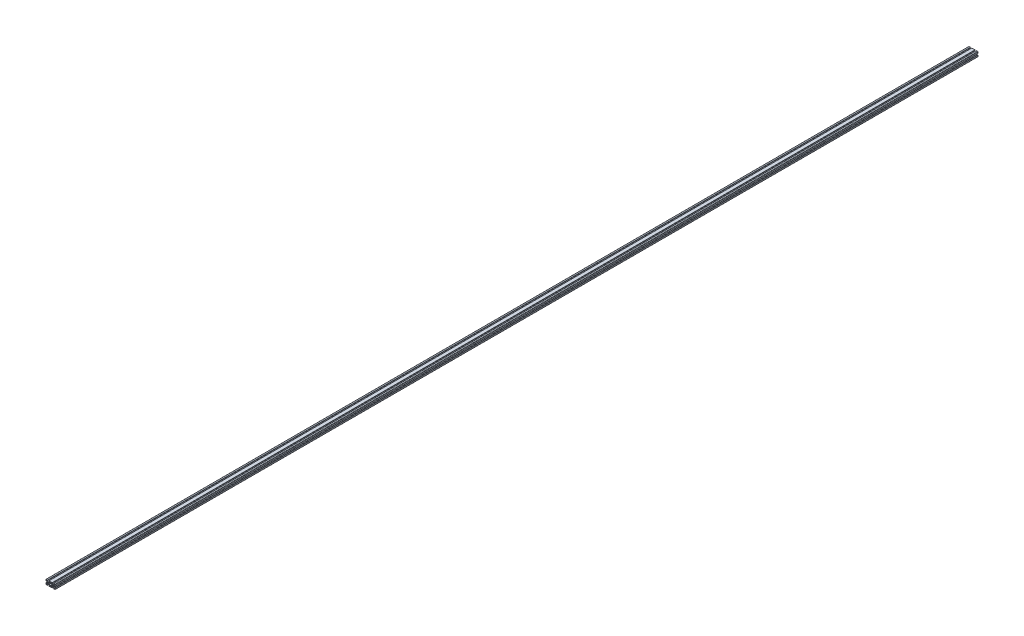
from build123d import *

# Parameters (mm, degrees)
EXTRUDE1_DEPTH = 4000


with BuildPart() as part:
    # Sketch1 → Extrude1 (new body)
    with BuildSketch(Plane.XY):
        with BuildLine():
            Line((-36.908207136, -63.334998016), (-32.140368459, -63.334998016))
            ThreePointArc((-32.140368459, -63.334998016), (-31.945965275, -63.373667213), (-31.781158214, -63.483787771))
            Line((-31.781158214, -63.483787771), (-28.678077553, -66.586868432))
            ThreePointArc((-28.678077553, -66.586868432), (-28.567956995, -66.751675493), (-28.529287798, -66.946078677))
            Line((-28.529287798, -66.946078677), (-28.529287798, -67.671998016))
            ThreePointArc((-28.529287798, -67.671998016), (-28.678077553, -68.03120826), (-29.037287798, -68.179998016))
            Line((-29.037287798, -68.179998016), (-31.386287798, -68.179998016))
            ThreePointArc((-31.386287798, -68.179998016), (-31.745498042, -68.328787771), (-31.894287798, -68.687998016))
            Line((-31.894287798, -68.687998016), (-31.894287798, -69.171998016))
            ThreePointArc((-31.894287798, -69.171998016), (-31.745498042, -69.53120826), (-31.386287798, -69.679998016))
            Line((-31.386287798, -69.679998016), (-17.662287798, -69.679998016))
            ThreePointArc((-17.662287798, -69.679998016), (-17.303077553, -69.53120826), (-17.154287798, -69.171998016))
            Line((-17.154287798, -69.171998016), (-17.154287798, -68.687998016))
            ThreePointArc((-17.154287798, -68.687998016), (-17.303077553, -68.328787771), (-17.662287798, -68.179998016))
            Line((-17.662287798, -68.179998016), (-20.011287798, -68.179998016))
            ThreePointArc((-20.011287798, -68.179998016), (-20.370498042, -68.03120826), (-20.519287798, -67.671998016))
            Line((-20.519287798, -67.671998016), (-20.519287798, -66.946078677))
            ThreePointArc((-20.519287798, -66.946078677), (-20.4806186, -66.751675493), (-20.370498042, -66.586868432))
            Line((-20.370498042, -66.586868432), (-17.267417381, -63.483787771))
            ThreePointArc((-17.267417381, -63.483787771), (-17.10261032, -63.373667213), (-16.908207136, -63.334998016))
            Line((-16.908207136, -63.334998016), (-12.140368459, -63.334998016))
            ThreePointArc((-12.140368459, -63.334998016), (-11.945965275, -63.373667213), (-11.781158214, -63.483787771))
            Line((-11.781158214, -63.483787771), (-8.678077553, -66.586868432))
            ThreePointArc((-8.678077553, -66.586868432), (-8.567956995, -66.751675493), (-8.529287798, -66.946078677))
            Line((-8.529287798, -66.946078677), (-8.529287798, -67.671998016))
            ThreePointArc((-8.529287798, -67.671998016), (-8.678077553, -68.03120826), (-9.037287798, -68.179998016))
            Line((-9.037287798, -68.179998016), (-11.386287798, -68.179998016))
            ThreePointArc((-11.386287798, -68.179998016), (-11.745498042, -68.328787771), (-11.894287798, -68.687998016))
            Line((-11.894287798, -68.687998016), (-11.894287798, -69.171998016))
            ThreePointArc((-11.894287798, -69.171998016), (-11.745498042, -69.53120826), (-11.386287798, -69.679998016))
            Line((-11.386287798, -69.679998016), (-6.024287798, -69.679998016))
            ThreePointArc((-6.024287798, -69.679998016), (-4.963627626, -69.240658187), (-4.524287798, -68.179998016))
            Line((-4.524287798, -68.179998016), (-4.524287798, -62.817998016))
            ThreePointArc((-4.524287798, -62.817998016), (-4.673077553, -62.458787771), (-5.032287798, -62.309998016))
            Line((-5.032287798, -62.309998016), (-5.516287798, -62.309998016))
            ThreePointArc((-5.516287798, -62.309998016), (-5.875498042, -62.458787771), (-6.024287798, -62.817998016))
            Line((-6.024287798, -62.817998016), (-6.024287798, -65.166998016))
            ThreePointArc((-6.024287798, -65.166998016), (-6.173077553, -65.52620826), (-6.532287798, -65.674998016))
            Line((-6.532287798, -65.674998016), (-7.258207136, -65.674998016))
            ThreePointArc((-7.258207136, -65.674998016), (-7.45261032, -65.636328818), (-7.617417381, -65.52620826))
            Line((-7.617417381, -65.52620826), (-10.720498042, -62.423127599))
            ThreePointArc((-10.720498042, -62.423127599), (-10.8306186, -62.258320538), (-10.869287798, -62.063917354))
            Line((-10.869287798, -62.063917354), (-10.869287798, -57.296078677))
            ThreePointArc((-10.869287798, -57.296078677), (-10.8306186, -57.101675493), (-10.720498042, -56.936868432))
            Line((-10.720498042, -56.936868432), (-7.617417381, -53.833787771))
            ThreePointArc((-7.617417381, -53.833787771), (-7.45261032, -53.723667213), (-7.258207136, -53.684998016))
            Line((-7.258207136, -53.684998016), (-6.532287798, -53.684998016))
            ThreePointArc((-6.532287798, -53.684998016), (-6.173077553, -53.833787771), (-6.024287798, -54.192998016))
            Line((-6.024287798, -54.192998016), (-6.024287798, -56.541998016))
            ThreePointArc((-6.024287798, -56.541998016), (-5.875498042, -56.90120826), (-5.516287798, -57.049998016))
            Line((-5.516287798, -57.049998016), (-5.032287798, -57.049998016))
            ThreePointArc((-5.032287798, -57.049998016), (-4.673077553, -56.90120826), (-4.524287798, -56.541998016))
            Line((-4.524287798, -56.541998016), (-4.524287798, -51.179998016))
            ThreePointArc((-4.524287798, -51.179998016), (-4.963627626, -50.119337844), (-6.024287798, -49.679998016))
            Line((-6.024287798, -49.679998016), (-11.386287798, -49.679998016))
            ThreePointArc((-11.386287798, -49.679998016), (-11.745498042, -49.828787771), (-11.894287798, -50.187998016))
            Line((-11.894287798, -50.187998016), (-11.894287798, -50.671998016))
            ThreePointArc((-11.894287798, -50.671998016), (-11.745498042, -51.03120826), (-11.386287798, -51.179998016))
            Line((-11.386287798, -51.179998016), (-9.037287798, -51.179998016))
            ThreePointArc((-9.037287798, -51.179998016), (-8.678077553, -51.328787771), (-8.529287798, -51.687998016))
            Line((-8.529287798, -51.687998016), (-8.529287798, -52.413917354))
            ThreePointArc((-8.529287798, -52.413917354), (-8.567956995, -52.608320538), (-8.678077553, -52.773127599))
            Line((-8.678077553, -52.773127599), (-11.781158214, -55.87620826))
            ThreePointArc((-11.781158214, -55.87620826), (-11.945965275, -55.986328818), (-12.140368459, -56.024998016))
            Line((-12.140368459, -56.024998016), (-16.908207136, -56.024998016))
            ThreePointArc((-16.908207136, -56.024998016), (-17.10261032, -55.986328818), (-17.267417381, -55.87620826))
            Line((-17.267417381, -55.87620826), (-20.370498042, -52.773127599))
            ThreePointArc((-20.370498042, -52.773127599), (-20.4806186, -52.608320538), (-20.519287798, -52.413917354))
            Line((-20.519287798, -52.413917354), (-20.519287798, -51.687998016))
            ThreePointArc((-20.519287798, -51.687998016), (-20.370498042, -51.328787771), (-20.011287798, -51.179998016))
            Line((-20.011287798, -51.179998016), (-17.662287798, -51.179998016))
            ThreePointArc((-17.662287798, -51.179998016), (-17.303077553, -51.03120826), (-17.154287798, -50.671998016))
            Line((-17.154287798, -50.671998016), (-17.154287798, -50.187998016))
            ThreePointArc((-17.154287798, -50.187998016), (-17.303077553, -49.828787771), (-17.662287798, -49.679998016))
            Line((-17.662287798, -49.679998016), (-31.386287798, -49.679998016))
            ThreePointArc((-31.386287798, -49.679998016), (-31.745498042, -49.828787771), (-31.894287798, -50.187998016))
            Line((-31.894287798, -50.187998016), (-31.894287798, -50.671998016))
            ThreePointArc((-31.894287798, -50.671998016), (-31.745498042, -51.03120826), (-31.386287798, -51.179998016))
            Line((-31.386287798, -51.179998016), (-29.037287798, -51.179998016))
            ThreePointArc((-29.037287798, -51.179998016), (-28.678077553, -51.328787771), (-28.529287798, -51.687998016))
            Line((-28.529287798, -51.687998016), (-28.529287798, -52.413917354))
            ThreePointArc((-28.529287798, -52.413917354), (-28.567956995, -52.608320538), (-28.678077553, -52.773127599))
            Line((-28.678077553, -52.773127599), (-31.781158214, -55.87620826))
            ThreePointArc((-31.781158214, -55.87620826), (-31.945965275, -55.986328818), (-32.140368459, -56.024998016))
            Line((-32.140368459, -56.024998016), (-36.908207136, -56.024998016))
            ThreePointArc((-36.908207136, -56.024998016), (-37.10261032, -55.986328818), (-37.267417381, -55.87620826))
            Line((-37.267417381, -55.87620826), (-40.370498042, -52.773127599))
            ThreePointArc((-40.370498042, -52.773127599), (-40.4806186, -52.608320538), (-40.519287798, -52.413917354))
            Line((-40.519287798, -52.413917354), (-40.519287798, -51.687998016))
            ThreePointArc((-40.519287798, -51.687998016), (-40.370498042, -51.328787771), (-40.011287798, -51.179998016))
            Line((-40.011287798, -51.179998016), (-37.662287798, -51.179998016))
            ThreePointArc((-37.662287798, -51.179998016), (-37.303077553, -51.03120826), (-37.154287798, -50.671998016))
            Line((-37.154287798, -50.671998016), (-37.154287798, -50.187998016))
            ThreePointArc((-37.154287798, -50.187998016), (-37.303077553, -49.828787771), (-37.662287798, -49.679998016))
            Line((-37.662287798, -49.679998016), (-43.024287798, -49.679998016))
            ThreePointArc((-43.024287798, -49.679998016), (-44.084947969, -50.119337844), (-44.524287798, -51.179998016))
            Line((-44.524287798, -51.179998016), (-44.524287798, -56.541998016))
            ThreePointArc((-44.524287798, -56.541998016), (-44.375498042, -56.90120826), (-44.016287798, -57.049998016))
            Line((-44.016287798, -57.049998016), (-43.532287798, -57.049998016))
            ThreePointArc((-43.532287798, -57.049998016), (-43.173077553, -56.90120826), (-43.024287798, -56.541998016))
            Line((-43.024287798, -56.541998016), (-43.024287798, -54.192998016))
            ThreePointArc((-43.024287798, -54.192998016), (-42.875498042, -53.833787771), (-42.516287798, -53.684998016))
            Line((-42.516287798, -53.684998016), (-41.790368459, -53.684998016))
            ThreePointArc((-41.790368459, -53.684998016), (-41.595965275, -53.723667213), (-41.431158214, -53.833787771))
            Line((-41.431158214, -53.833787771), (-38.328077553, -56.936868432))
            ThreePointArc((-38.328077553, -56.936868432), (-38.217956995, -57.101675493), (-38.179287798, -57.296078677))
            Line((-38.179287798, -57.296078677), (-38.179287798, -62.063917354))
            ThreePointArc((-38.179287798, -62.063917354), (-38.217956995, -62.258320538), (-38.328077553, -62.423127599))
            Line((-38.328077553, -62.423127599), (-41.431158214, -65.52620826))
            ThreePointArc((-41.431158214, -65.52620826), (-41.595965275, -65.636328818), (-41.790368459, -65.674998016))
            Line((-41.790368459, -65.674998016), (-42.516287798, -65.674998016))
            ThreePointArc((-42.516287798, -65.674998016), (-42.875498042, -65.52620826), (-43.024287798, -65.166998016))
            Line((-43.024287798, -65.166998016), (-43.024287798, -62.817998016))
            ThreePointArc((-43.024287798, -62.817998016), (-43.173077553, -62.458787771), (-43.532287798, -62.309998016))
            Line((-43.532287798, -62.309998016), (-44.016287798, -62.309998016))
            ThreePointArc((-44.016287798, -62.309998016), (-44.375498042, -62.458787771), (-44.524287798, -62.817998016))
            Line((-44.524287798, -62.817998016), (-44.524287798, -68.179998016))
            ThreePointArc((-44.524287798, -68.179998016), (-44.084947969, -69.240658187), (-43.024287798, -69.679998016))
            Line((-43.024287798, -69.679998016), (-37.662287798, -69.679998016))
            ThreePointArc((-37.662287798, -69.679998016), (-37.303077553, -69.53120826), (-37.154287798, -69.171998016))
            Line((-37.154287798, -69.171998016), (-37.154287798, -68.687998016))
            ThreePointArc((-37.154287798, -68.687998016), (-37.303077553, -68.328787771), (-37.662287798, -68.179998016))
            Line((-37.662287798, -68.179998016), (-40.011287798, -68.179998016))
            ThreePointArc((-40.011287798, -68.179998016), (-40.370498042, -68.03120826), (-40.519287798, -67.671998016))
            Line((-40.519287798, -67.671998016), (-40.519287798, -66.946078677))
            ThreePointArc((-40.519287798, -66.946078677), (-40.4806186, -66.751675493), (-40.370498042, -66.586868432))
            Line((-40.370498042, -66.586868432), (-37.267417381, -63.483787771))
            ThreePointArc((-37.267417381, -63.483787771), (-37.10261032, -63.373667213), (-36.908207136, -63.334998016))
        make_face()
        with BuildLine():
            Line((-16.649188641, -61.984503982), (-16.828793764, -61.804898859))
            ThreePointArc((-16.828793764, -61.804898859), (-17.030225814, -61.036465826), (-16.459421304, -60.483974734))
            ThreePointArc((-16.459421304, -60.483974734), (-16.619787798, -59.679998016), (-16.459421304, -58.876021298))
            ThreePointArc((-16.459421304, -58.876021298), (-17.030225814, -58.323530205), (-16.828793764, -57.555097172))
            Line((-16.828793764, -57.555097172), (-16.649188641, -57.375492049))
            ThreePointArc((-16.649188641, -57.375492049), (-15.880755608, -57.174059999), (-15.328264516, -57.744864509))
            ThreePointArc((-15.328264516, -57.744864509), (-14.524287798, -57.584498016), (-13.72031108, -57.744864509))
            ThreePointArc((-13.72031108, -57.744864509), (-13.167819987, -57.174059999), (-12.399386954, -57.375492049))
            Line((-12.399386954, -57.375492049), (-12.219781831, -57.555097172))
            ThreePointArc((-12.219781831, -57.555097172), (-12.018349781, -58.323530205), (-12.589154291, -58.876021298))
            ThreePointArc((-12.589154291, -58.876021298), (-12.428787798, -59.679998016), (-12.589154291, -60.483974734))
            ThreePointArc((-12.589154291, -60.483974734), (-12.018349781, -61.036465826), (-12.219781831, -61.804898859))
            Line((-12.219781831, -61.804898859), (-12.399386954, -61.984503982))
            ThreePointArc((-12.399386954, -61.984503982), (-13.167819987, -62.185936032), (-13.72031108, -61.615131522))
            ThreePointArc((-13.72031108, -61.615131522), (-14.524287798, -61.775498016), (-15.328264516, -61.615131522))
            ThreePointArc((-15.328264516, -61.615131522), (-15.880755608, -62.185936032), (-16.649188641, -61.984503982))
        make_face(mode=Mode.SUBTRACT)
        with BuildLine():
            Line((-27.029287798, -67.671998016), (-27.029287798, -66.324758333))
            ThreePointArc((-27.029287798, -66.324758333), (-27.067956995, -66.13035515), (-27.178077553, -65.965548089))
            Line((-27.178077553, -65.965548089), (-30.720498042, -62.423127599))
            ThreePointArc((-30.720498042, -62.423127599), (-30.8306186, -62.258320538), (-30.869287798, -62.063917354))
            Line((-30.869287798, -62.063917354), (-30.869287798, -57.296078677))
            ThreePointArc((-30.869287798, -57.296078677), (-30.8306186, -57.101675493), (-30.720498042, -56.936868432))
            Line((-30.720498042, -56.936868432), (-27.178077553, -53.394447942))
            ThreePointArc((-27.178077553, -53.394447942), (-27.067956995, -53.229640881), (-27.029287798, -53.035237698))
            Line((-27.029287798, -53.035237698), (-27.029287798, -51.687998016))
            ThreePointArc((-27.029287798, -51.687998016), (-26.880498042, -51.328787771), (-26.521287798, -51.179998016))
            Line((-26.521287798, -51.179998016), (-22.527287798, -51.179998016))
            ThreePointArc((-22.527287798, -51.179998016), (-22.168077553, -51.328787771), (-22.019287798, -51.687998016))
            Line((-22.019287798, -51.687998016), (-22.019287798, -53.035237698))
            ThreePointArc((-22.019287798, -53.035237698), (-21.9806186, -53.229640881), (-21.870498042, -53.394447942))
            Line((-21.870498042, -53.394447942), (-18.328077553, -56.936868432))
            ThreePointArc((-18.328077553, -56.936868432), (-18.217956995, -57.101675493), (-18.179287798, -57.296078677))
            Line((-18.179287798, -57.296078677), (-18.179287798, -62.063917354))
            ThreePointArc((-18.179287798, -62.063917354), (-18.217956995, -62.258320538), (-18.328077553, -62.423127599))
            Line((-18.328077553, -62.423127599), (-21.870498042, -65.965548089))
            ThreePointArc((-21.870498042, -65.965548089), (-21.9806186, -66.13035515), (-22.019287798, -66.324758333))
            Line((-22.019287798, -66.324758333), (-22.019287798, -67.671998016))
            ThreePointArc((-22.019287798, -67.671998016), (-22.168077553, -68.03120826), (-22.527287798, -68.179998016))
            Line((-22.527287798, -68.179998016), (-26.521287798, -68.179998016))
            ThreePointArc((-26.521287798, -68.179998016), (-26.880498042, -68.03120826), (-27.029287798, -67.671998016))
        make_face(mode=Mode.SUBTRACT)
        with BuildLine():
            Line((-36.649188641, -61.984503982), (-36.828793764, -61.804898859))
            ThreePointArc((-36.828793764, -61.804898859), (-37.030225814, -61.036465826), (-36.459421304, -60.483974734))
            ThreePointArc((-36.459421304, -60.483974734), (-36.619787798, -59.679998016), (-36.459421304, -58.876021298))
            ThreePointArc((-36.459421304, -58.876021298), (-37.030225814, -58.323530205), (-36.828793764, -57.555097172))
            Line((-36.828793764, -57.555097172), (-36.649188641, -57.375492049))
            ThreePointArc((-36.649188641, -57.375492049), (-35.880755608, -57.174059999), (-35.328264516, -57.744864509))
            ThreePointArc((-35.328264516, -57.744864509), (-34.524287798, -57.584498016), (-33.72031108, -57.744864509))
            ThreePointArc((-33.72031108, -57.744864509), (-33.167819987, -57.174059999), (-32.399386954, -57.375492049))
            Line((-32.399386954, -57.375492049), (-32.219781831, -57.555097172))
            ThreePointArc((-32.219781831, -57.555097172), (-32.018349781, -58.323530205), (-32.589154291, -58.876021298))
            ThreePointArc((-32.589154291, -58.876021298), (-32.428787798, -59.679998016), (-32.589154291, -60.483974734))
            ThreePointArc((-32.589154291, -60.483974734), (-32.018349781, -61.036465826), (-32.219781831, -61.804898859))
            Line((-32.219781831, -61.804898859), (-32.399386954, -61.984503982))
            ThreePointArc((-32.399386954, -61.984503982), (-33.167819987, -62.185936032), (-33.72031108, -61.615131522))
            ThreePointArc((-33.72031108, -61.615131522), (-34.524287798, -61.775498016), (-35.328264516, -61.615131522))
            ThreePointArc((-35.328264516, -61.615131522), (-35.880755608, -62.185936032), (-36.649188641, -61.984503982))
        make_face(mode=Mode.SUBTRACT)
    extrude(amount=EXTRUDE1_DEPTH)


solid = part.part
